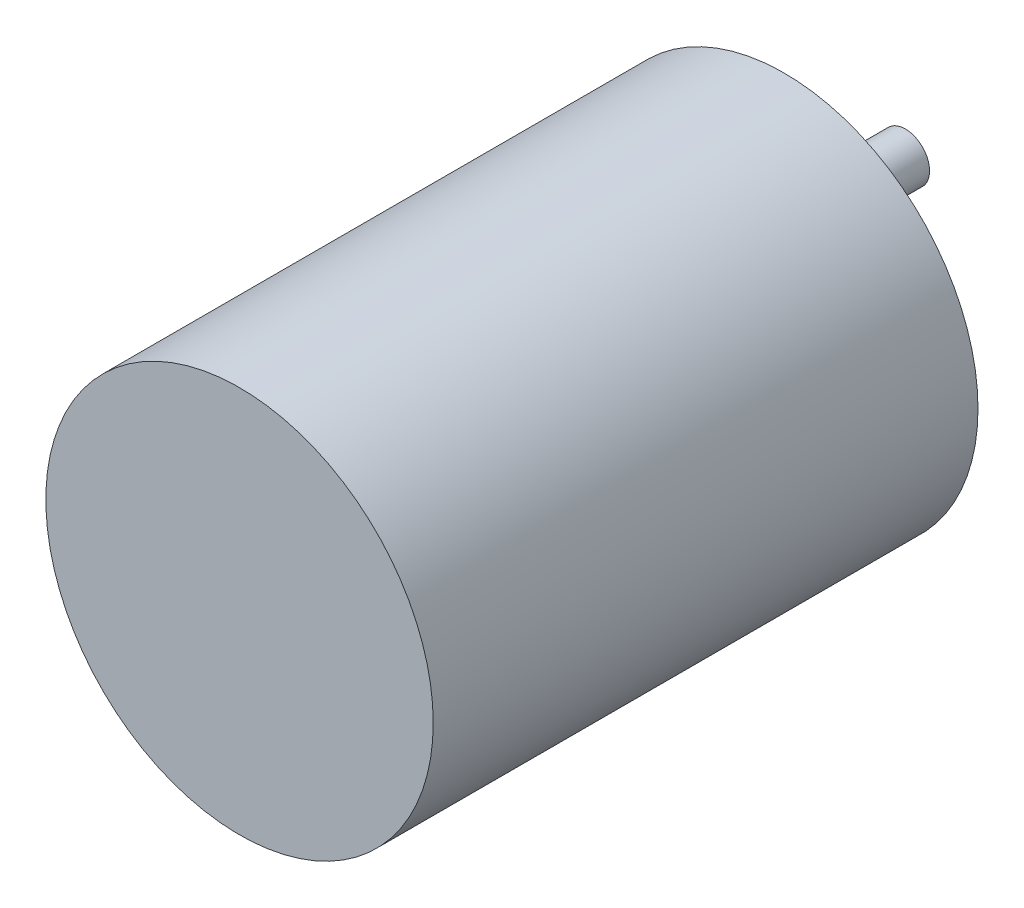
from build123d import *

# Parameters (mm, degrees)
SKETCH_1_R      = 4.064
EXTRUDE_1_DEPTH = 11.43
SKETCH_2_R      = 0.508
EXTRUDE_2_DEPTH = 2.54


with BuildPart() as part:
    # Sketch 1 → Extrude 1 (new body)
    with BuildSketch(Plane.XY):
        Circle(SKETCH_1_R)
    extrude(amount=EXTRUDE_1_DEPTH)

    # Sketch 2 → Extrude 2 (add)
    with BuildSketch(Plane(origin=(0, 0, 0), x_dir=(-1, 0, 0), z_dir=(0, 0, -1))):
        with Locations(Location((0, 1.27, 0), (0, 0, 180))):
            Circle(SKETCH_2_R)
        with Locations(Location((0, -1.27, 0), (0, 0, 180))):
            Circle(SKETCH_2_R)
    extrude(amount=EXTRUDE_2_DEPTH)


solid = part.part
